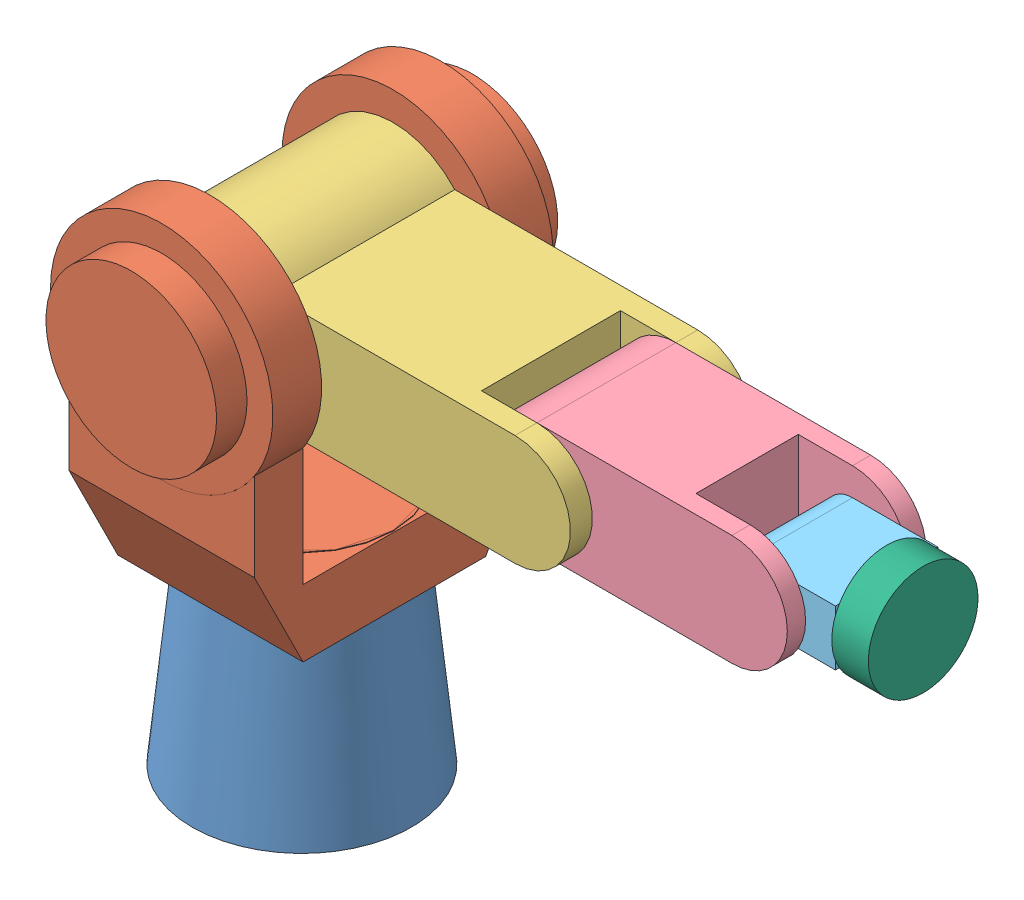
SolidWorks assembly Brazo.SLDASM, configuration Default (file format 13000). Lengths in mm.
Overall size (601.26 441.77 280).
6 component instances, 6 part files, 10 mates.
Components (placement in the parent):
- Base-1: Base.SLDPRT [Default] at origin size (180 148 180)
- Soporte-1: Soporte.SLDPRT [Default] at (0 148 0) x (0 0 1) z (-1 0 0) size (280 293.77 182.52)
- Eslabon2-1: Eslabon2.SLDPRT [Default] at (-0.0044 350.5132 75) size (363.5 136 150)
- Eslabon3-1: Eslabon3.SLDPRT [Default] at (249.9956 350.5132 57) size (251 91 114)
- Eslabon4-1: Eslabon4.SLDPRT [Default] at (409.9956 350.5132 42) size (93.25 45.5 84)
- Eslabon5-1: Eslabon5.SLDPRT [Default] at (479.9956 350.5132 0) x (1 0 0) z (0 0.945238 0.326383) size (30 90 90)
Mates (geometry in assembly coordinates):
- Concentric9: concentric anti-aligned: circle of Base-1; cylinder of Soporte-1 through (0 203.5 0) axis (0 -1 0) radius 75
- Coincident23: coincident anti-aligned: plane of Base-1 through (0 148 0) normal (0 1 0); plane of Soporte-1 through (-76 148 75) normal (0 -1 0)
- Coincident4: coincident anti-aligned: plane of Soporte-1 through (-0.0044 350.5132 -75) normal (0 0 1); plane of Eslabon2-1 through (249.9956 350.5132 -75) normal (0 0 -1)
- Concentric3: concentric anti-aligned: circle of Soporte-1; circle of Eslabon2-1
- Coincident5: coincident anti-aligned: plane of Eslabon2-1; plane of Eslabon3-1
- Concentric4: concentric anti-aligned: circle of Eslabon2-1; circle of Eslabon3-1
- Coincident7: coincident anti-aligned: plane of Eslabon3-1; plane of Eslabon4-1
- Concentric5: concentric anti-aligned: circle of Eslabon3-1; circle of Eslabon4-1
- Coincident25: coincident anti-aligned: plane of Eslabon4-1 through (479.9956 373.2632 -42) normal (1 0 0); plane of Eslabon5-1 through (479.9956 350.5132 0) normal (-1 0 0)
- Concentric10: concentric aligned: cylinder of Eslabon4-1 through (480.4956 350.5132 0) axis (-1 0 0) radius 22.75; cylinder of Eslabon5-1 through (509.9956 350.5132 0) axis (-1 0 0) radius 45
